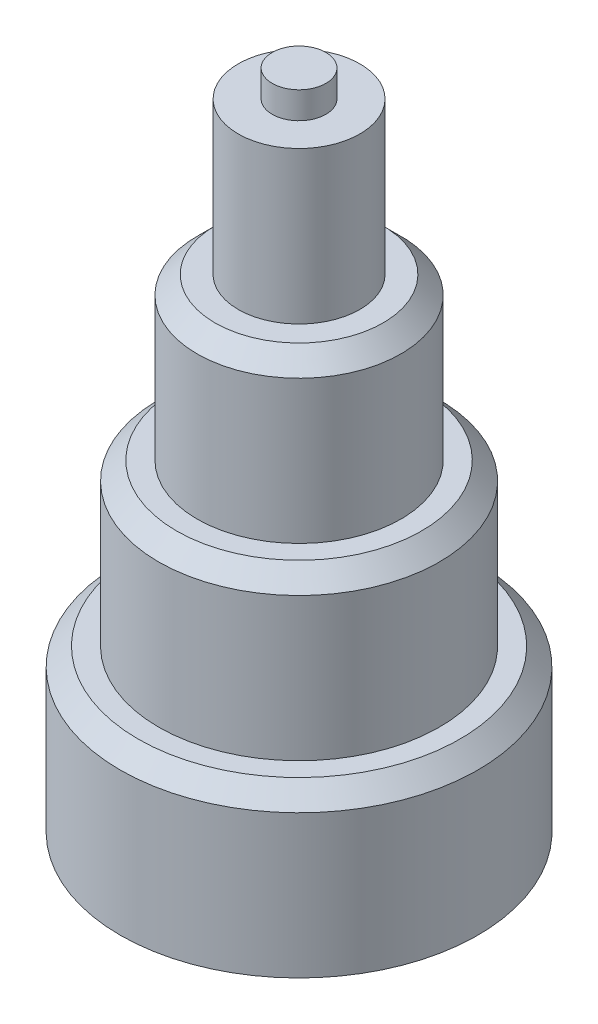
from build123d import *

# Parameters (mm, degrees)
SKETCH1_R                 = 10
BOSS_EXTRUDE1_DEPTH       = 9
SKETCH2_R                 = 7.85
BOSS_EXTRUDE2_DEPTH       = 9
SKETCH3_R                 = 5.7
BOSS_EXTRUDE3_DEPTH       = 9
SKETCH4_R                 = 3.4
BOSS_EXTRUDE4_DEPTH       = 8.5
SKETCH5_R                 = 1.5
BOSS_EXTRUDE5_DEPTH       = 1.5
CHAMFER1_SIZE             = 1
M5X0_8_TAPPED_HOLE1_D     = 4.2
M5X0_8_TAPPED_HOLE1_DEPTH = 17.4
M5X0_8_TAPPED_HOLE1_TIP   = 1.2618073


with BuildPart() as part:
    # Sketch1 → Boss-Extrude1 (new body)
    with BuildSketch(Plane(origin=(0, 0, 0), x_dir=(1, 0, 0), z_dir=(0, 1, 0))):
        with Locations(Location((0, 0, 0), (0, 0, 270))):
            Circle(SKETCH1_R)
    extrude(amount=BOSS_EXTRUDE1_DEPTH)

    # Sketch2 → Boss-Extrude2 (add)
    with BuildSketch(Plane(origin=(0, 9, 0), x_dir=(1, 0, 0), z_dir=(0, 1, 0))):
        with Locations(Location((0, 0, 0), (0, 0, 270))):
            Circle(SKETCH2_R)
    extrude(amount=BOSS_EXTRUDE2_DEPTH)

    # Sketch3 → Boss-Extrude3 (add)
    with BuildSketch(Plane(origin=(0, 18, 0), x_dir=(1, 0, 0), z_dir=(0, 1, 0))):
        with Locations(Location((0, 0, 0), (0, 0, 270))):
            Circle(SKETCH3_R)
    extrude(amount=BOSS_EXTRUDE3_DEPTH)

    # Sketch4 → Boss-Extrude4 (add)
    with BuildSketch(Plane(origin=(0, 27, 0), x_dir=(1, 0, 0), z_dir=(0, 1, 0))):
        with Locations(Location((0, 0, 0), (0, 0, 270))):
            Circle(SKETCH4_R)
    extrude(amount=BOSS_EXTRUDE4_DEPTH)

    # Sketch5 → Boss-Extrude5 (add)
    with BuildSketch(Plane(origin=(0, 35.5, 0), x_dir=(1, 0, 0), z_dir=(0, 1, 0))):
        with Locations(Location((0, 0, 0), (0, 0, 270))):
            Circle(SKETCH5_R)
    extrude(amount=BOSS_EXTRUDE5_DEPTH)

    # Chamfer1
    chamfer1_edges = [part.edges().sort_by_distance(p)[0] for p in [
        (0, 27, -5.7),
        (0, 9, -10),
        (0, 18, -7.85),
    ]]
    chamfer(chamfer1_edges, length=CHAMFER1_SIZE)

    # M5x0.8 Tapped Hole1
    with Locations(Plane(origin=(0, 0, 0), x_dir=(-1, 0, 0), z_dir=(0, -1, 0))):
        with Locations((0, 0)):
            Hole(M5X0_8_TAPPED_HOLE1_D / 2, depth=M5X0_8_TAPPED_HOLE1_DEPTH)
            with Locations((0, 0, -(M5X0_8_TAPPED_HOLE1_DEPTH + M5X0_8_TAPPED_HOLE1_TIP / 2))):  # 118° drill point
                Cone(0, M5X0_8_TAPPED_HOLE1_D / 2, M5X0_8_TAPPED_HOLE1_TIP, mode=Mode.SUBTRACT)


solid = part.part
